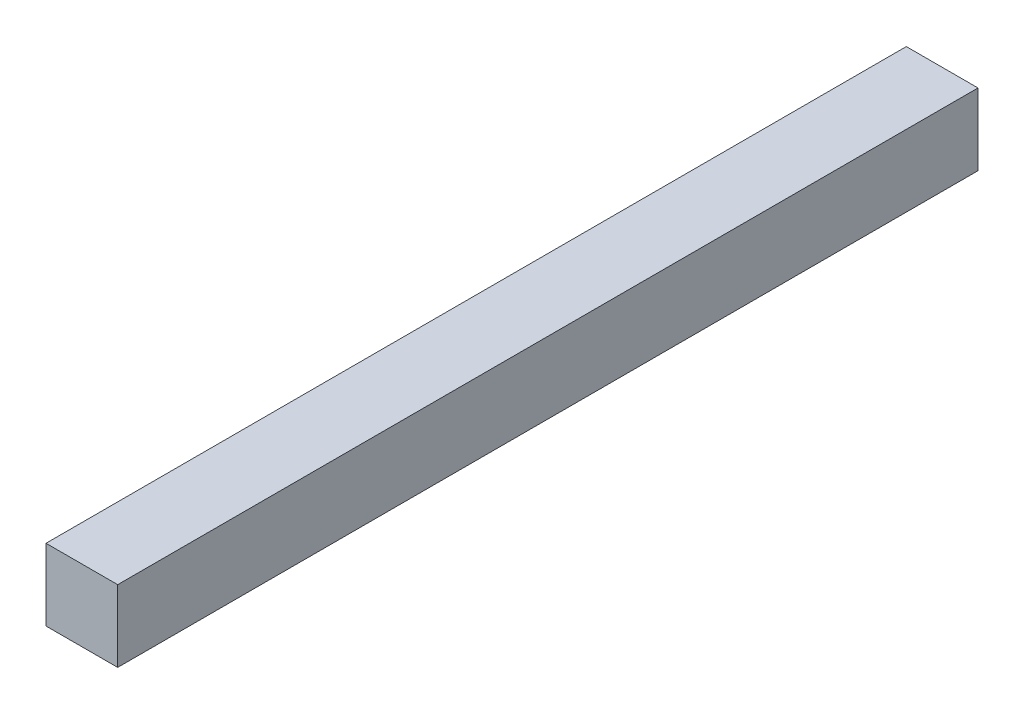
from build123d import *

# Parameters (mm, degrees)
ESQUISSE1_W      = 25
ESQUISSE1_H      = 25
EXTRUSION1_DEPTH = 300


with BuildPart() as part:
    # Esquisse1 → Extrusion1 (new body)
    with BuildSketch(Plane.XY):
        with Locations((12.5, 12.5)):
            Rectangle(ESQUISSE1_W, ESQUISSE1_H)
    extrude(amount=EXTRUSION1_DEPTH)


solid = part.part
